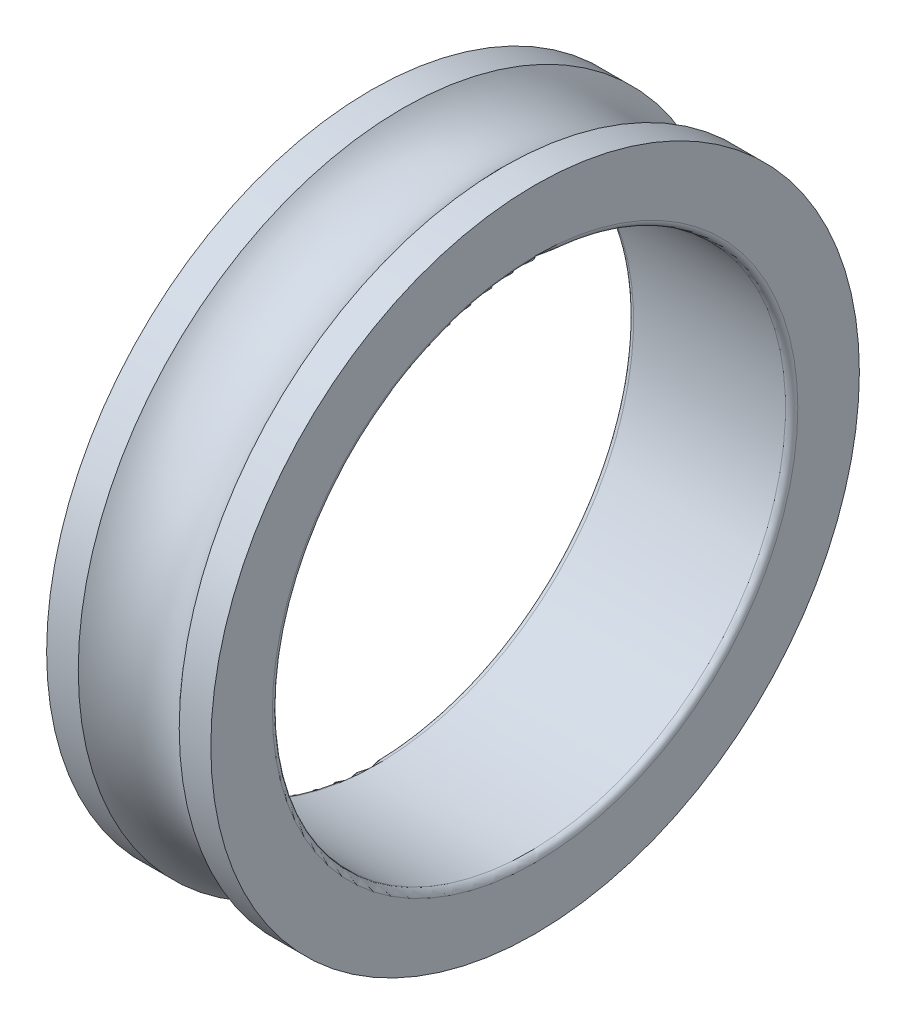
ISO-10303-21;
HEADER;
FILE_DESCRIPTION(('STEP AP214'),'2;1');
FILE_NAME('part.step','',(''),(''),'','','');
FILE_SCHEMA(('AUTOMOTIVE_DESIGN { 1 0 10303 214 1 1 1 1 }'));
ENDSEC;
DATA;
#1=APPLICATION_CONTEXT('core data for automotive mechanical design processes');
#2=APPLICATION_PROTOCOL_DEFINITION('international standard','automotive_design',2000,#1);
#3=PRODUCT_CONTEXT('',#1,'mechanical');
#4=PRODUCT('Part','Part','',(#3));
#5=PRODUCT_RELATED_PRODUCT_CATEGORY('part','',(#4));
#6=PRODUCT_DEFINITION_FORMATION('','',#4);
#7=PRODUCT_DEFINITION_CONTEXT('part definition',#1,'design');
#8=PRODUCT_DEFINITION('design','',#6,#7);
#9=PRODUCT_DEFINITION_SHAPE('','',#8);
#10=(LENGTH_UNIT() NAMED_UNIT(*) SI_UNIT(.MILLI.,.METRE.));
#11=(NAMED_UNIT(*) PLANE_ANGLE_UNIT() SI_UNIT($,.RADIAN.));
#12=(NAMED_UNIT(*) SI_UNIT($,.STERADIAN.) SOLID_ANGLE_UNIT());
#13=UNCERTAINTY_MEASURE_WITH_UNIT(LENGTH_MEASURE(1.E-05),#10,'distance_accuracy_value','');
#14=(GEOMETRIC_REPRESENTATION_CONTEXT(3) GLOBAL_UNCERTAINTY_ASSIGNED_CONTEXT((#13)) GLOBAL_UNIT_ASSIGNED_CONTEXT((#10,
#11,#12)) REPRESENTATION_CONTEXT('',''));
#15=CARTESIAN_POINT('',(0.,0.,0.));
#16=DIRECTION('',(0.,0.,1.));
#17=DIRECTION('',(1.,0.,0.));
#18=AXIS2_PLACEMENT_3D('',#15,#16,#17);
#19=CARTESIAN_POINT('',(0.300000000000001,0.,0.));
#20=DIRECTION('',(-1.,0.,0.));
#21=DIRECTION('',(0.,0.,1.));
#22=AXIS2_PLACEMENT_3D('',#19,#20,#21);
#23=TOROIDAL_SURFACE('',#22,12.8,0.3);
#24=CARTESIAN_POINT('',(0.300000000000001,0.,0.));
#25=DIRECTION('',(-1.,0.,0.));
#26=DIRECTION('',(0.,0.,1.));
#27=AXIS2_PLACEMENT_3D('',#24,#25,#26);
#28=CIRCLE('',#27,12.5);
#29=CARTESIAN_POINT('',(0.300000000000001,0.,12.5));
#30=VERTEX_POINT('',#29);
#31=EDGE_CURVE('E10',#30,#30,#28,.T.);
#32=ORIENTED_EDGE('',*,*,#31,.F.);
#33=EDGE_LOOP('',(#32));
#34=FACE_BOUND('',#33,.T.);
#35=CARTESIAN_POINT('',(0.,0.,0.));
#36=DIRECTION('',(-1.,0.,0.));
#37=DIRECTION('',(0.,0.,1.));
#38=AXIS2_PLACEMENT_3D('',#35,#36,#37);
#39=CIRCLE('',#38,12.8);
#40=CARTESIAN_POINT('',(0.,0.,12.8));
#41=VERTEX_POINT('',#40);
#42=EDGE_CURVE('E57',#41,#41,#39,.T.);
#43=ORIENTED_EDGE('',*,*,#42,.T.);
#44=EDGE_LOOP('',(#43));
#45=FACE_BOUND('',#44,.T.);
#46=ADVANCED_FACE('F29',(#34,#45),#23,.T.);
#47=CARTESIAN_POINT('',(0.,0.,0.));
#48=DIRECTION('',(-1.,0.,0.));
#49=DIRECTION('',(0.,0.,1.));
#50=AXIS2_PLACEMENT_3D('',#47,#48,#49);
#51=CYLINDRICAL_SURFACE('',#50,12.5);
#52=CARTESIAN_POINT('',(7.7,0.,0.));
#53=DIRECTION('',(-1.,0.,0.));
#54=DIRECTION('',(0.,0.,1.));
#55=AXIS2_PLACEMENT_3D('',#52,#53,#54);
#56=CIRCLE('',#55,12.5);
#57=CARTESIAN_POINT('',(7.7,0.,12.5));
#58=VERTEX_POINT('',#57);
#59=EDGE_CURVE('E35',#58,#58,#56,.T.);
#60=ORIENTED_EDGE('',*,*,#59,.F.);
#61=EDGE_LOOP('',(#60));
#62=FACE_BOUND('',#61,.T.);
#63=ORIENTED_EDGE('',*,*,#31,.T.);
#64=EDGE_LOOP('',(#63));
#65=FACE_BOUND('',#64,.T.);
#66=ADVANCED_FACE('F94',(#62,#65),#51,.F.);
#67=CARTESIAN_POINT('',(7.7,0.,0.));
#68=DIRECTION('',(-1.,0.,0.));
#69=DIRECTION('',(0.,0.,1.));
#70=AXIS2_PLACEMENT_3D('',#67,#68,#69);
#71=TOROIDAL_SURFACE('',#70,12.8,0.3);
#72=CARTESIAN_POINT('',(8.,0.,0.));
#73=DIRECTION('',(-1.,0.,0.));
#74=DIRECTION('',(0.,0.,1.));
#75=AXIS2_PLACEMENT_3D('',#72,#73,#74);
#76=CIRCLE('',#75,12.8);
#77=CARTESIAN_POINT('',(8.,0.,12.8));
#78=VERTEX_POINT('',#77);
#79=EDGE_CURVE('E39',#78,#78,#76,.T.);
#80=ORIENTED_EDGE('',*,*,#79,.F.);
#81=EDGE_LOOP('',(#80));
#82=FACE_BOUND('',#81,.T.);
#83=ORIENTED_EDGE('',*,*,#59,.T.);
#84=EDGE_LOOP('',(#83));
#85=FACE_BOUND('',#84,.T.);
#86=ADVANCED_FACE('F89',(#82,#85),#71,.T.);
#87=CARTESIAN_POINT('',(8.,0.,-15.8));
#88=DIRECTION('',(-1.,0.,0.));
#89=DIRECTION('',(0.,0.,1.));
#90=AXIS2_PLACEMENT_3D('',#87,#88,#89);
#91=PLANE('',#90);
#92=CARTESIAN_POINT('',(8.,0.,0.));
#93=DIRECTION('',(-1.,0.,0.));
#94=DIRECTION('',(0.,0.,1.));
#95=AXIS2_PLACEMENT_3D('',#92,#93,#94);
#96=CIRCLE('',#95,15.8);
#97=CARTESIAN_POINT('',(8.,0.,15.8));
#98=VERTEX_POINT('',#97);
#99=EDGE_CURVE('E43',#98,#98,#96,.T.);
#100=ORIENTED_EDGE('',*,*,#99,.F.);
#101=EDGE_LOOP('',(#100));
#102=FACE_BOUND('',#101,.T.);
#103=ORIENTED_EDGE('',*,*,#79,.T.);
#104=EDGE_LOOP('',(#103));
#105=FACE_BOUND('',#104,.T.);
#106=ADVANCED_FACE('F83',(#102,#105),#91,.F.);
#107=CARTESIAN_POINT('',(0.,0.,0.));
#108=DIRECTION('',(-1.,0.,0.));
#109=DIRECTION('',(0.,0.,1.));
#110=AXIS2_PLACEMENT_3D('',#107,#108,#109);
#111=CYLINDRICAL_SURFACE('',#110,15.8);
#112=CARTESIAN_POINT('',(6.45967477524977,0.,0.));
#113=DIRECTION('',(-1.,0.,0.));
#114=DIRECTION('',(0.,0.,1.));
#115=AXIS2_PLACEMENT_3D('',#112,#113,#114);
#116=CIRCLE('',#115,15.8);
#117=CARTESIAN_POINT('',(6.45967477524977,0.,15.8));
#118=VERTEX_POINT('',#117);
#119=EDGE_CURVE('E48',#118,#118,#116,.T.);
#120=ORIENTED_EDGE('',*,*,#119,.F.);
#121=EDGE_LOOP('',(#120));
#122=FACE_BOUND('',#121,.T.);
#123=ORIENTED_EDGE('',*,*,#99,.T.);
#124=EDGE_LOOP('',(#123));
#125=FACE_BOUND('',#124,.T.);
#126=ADVANCED_FACE('F77',(#122,#125),#111,.T.);
#127=CARTESIAN_POINT('',(4.,0.,0.));
#128=DIRECTION('',(-1.,0.,0.));
#129=DIRECTION('',(0.,0.,1.));
#130=AXIS2_PLACEMENT_3D('',#127,#128,#129);
#131=TOROIDAL_SURFACE('',#130,18.,3.3);
#132=CARTESIAN_POINT('',(1.54032522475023,0.,0.));
#133=DIRECTION('',(-1.,0.,0.));
#134=DIRECTION('',(0.,0.,1.));
#135=AXIS2_PLACEMENT_3D('',#132,#133,#134);
#136=CIRCLE('',#135,15.8);
#137=CARTESIAN_POINT('',(1.54032522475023,0.,15.8));
#138=VERTEX_POINT('',#137);
#139=EDGE_CURVE('E51',#138,#138,#136,.T.);
#140=ORIENTED_EDGE('',*,*,#139,.F.);
#141=EDGE_LOOP('',(#140));
#142=FACE_BOUND('',#141,.T.);
#143=ORIENTED_EDGE('',*,*,#119,.T.);
#144=EDGE_LOOP('',(#143));
#145=FACE_BOUND('',#144,.T.);
#146=ADVANCED_FACE('F71',(#142,#145),#131,.F.);
#147=CARTESIAN_POINT('',(0.,0.,0.));
#148=DIRECTION('',(-1.,0.,0.));
#149=DIRECTION('',(0.,0.,1.));
#150=AXIS2_PLACEMENT_3D('',#147,#148,#149);
#151=CYLINDRICAL_SURFACE('',#150,15.8);
#152=CARTESIAN_POINT('',(0.,0.,0.));
#153=DIRECTION('',(-1.,0.,0.));
#154=DIRECTION('',(0.,0.,1.));
#155=AXIS2_PLACEMENT_3D('',#152,#153,#154);
#156=CIRCLE('',#155,15.8);
#157=CARTESIAN_POINT('',(0.,0.,15.8));
#158=VERTEX_POINT('',#157);
#159=EDGE_CURVE('E54',#158,#158,#156,.T.);
#160=ORIENTED_EDGE('',*,*,#159,.F.);
#161=EDGE_LOOP('',(#160));
#162=FACE_BOUND('',#161,.T.);
#163=ORIENTED_EDGE('',*,*,#139,.T.);
#164=EDGE_LOOP('',(#163));
#165=FACE_BOUND('',#164,.T.);
#166=ADVANCED_FACE('F65',(#162,#165),#151,.T.);
#167=CARTESIAN_POINT('',(0.,0.,-15.8));
#168=DIRECTION('',(1.,0.,0.));
#169=DIRECTION('',(0.,0.,-1.));
#170=AXIS2_PLACEMENT_3D('',#167,#168,#169);
#171=PLANE('',#170);
#172=ORIENTED_EDGE('',*,*,#42,.F.);
#173=EDGE_LOOP('',(#172));
#174=FACE_BOUND('',#173,.T.);
#175=ORIENTED_EDGE('',*,*,#159,.T.);
#176=EDGE_LOOP('',(#175));
#177=FACE_BOUND('',#176,.T.);
#178=ADVANCED_FACE('F62',(#174,#177),#171,.F.);
#179=CLOSED_SHELL('',(#46,#66,#86,#106,#126,#146,#166,#178));
#180=MANIFOLD_SOLID_BREP('B2',#179);
#181=ADVANCED_BREP_SHAPE_REPRESENTATION('',(#18,#180),#14);
#182=SHAPE_DEFINITION_REPRESENTATION(#9,#181);
ENDSEC;
END-ISO-10303-21;
